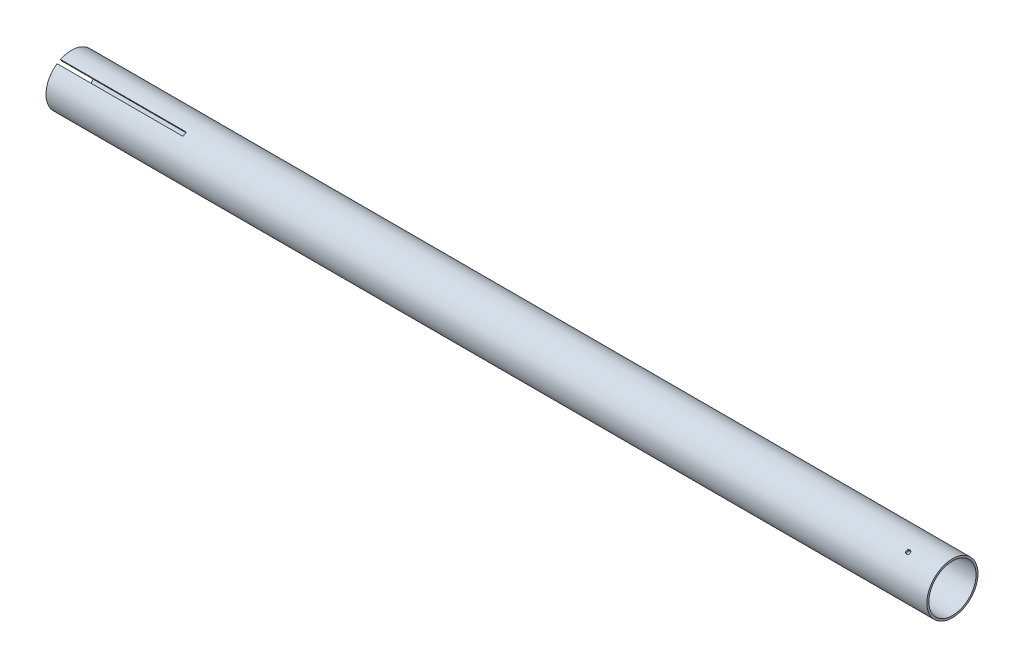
ISO-10303-21;
HEADER;
FILE_DESCRIPTION(('STEP AP214'),'2;1');
FILE_NAME('part.step','',(''),(''),'','','');
FILE_SCHEMA(('AUTOMOTIVE_DESIGN { 1 0 10303 214 1 1 1 1 }'));
ENDSEC;
DATA;
#1=APPLICATION_CONTEXT('core data for automotive mechanical design processes');
#2=APPLICATION_PROTOCOL_DEFINITION('international standard','automotive_design',2000,#1);
#3=PRODUCT_CONTEXT('',#1,'mechanical');
#4=PRODUCT('Part','Part','',(#3));
#5=PRODUCT_RELATED_PRODUCT_CATEGORY('part','',(#4));
#6=PRODUCT_DEFINITION_FORMATION('','',#4);
#7=PRODUCT_DEFINITION_CONTEXT('part definition',#1,'design');
#8=PRODUCT_DEFINITION('design','',#6,#7);
#9=PRODUCT_DEFINITION_SHAPE('','',#8);
#10=(LENGTH_UNIT() NAMED_UNIT(*) SI_UNIT(.MILLI.,.METRE.));
#11=(NAMED_UNIT(*) PLANE_ANGLE_UNIT() SI_UNIT($,.RADIAN.));
#12=(NAMED_UNIT(*) SI_UNIT($,.STERADIAN.) SOLID_ANGLE_UNIT());
#13=UNCERTAINTY_MEASURE_WITH_UNIT(LENGTH_MEASURE(1.E-05),#10,'distance_accuracy_value','');
#14=(GEOMETRIC_REPRESENTATION_CONTEXT(3) GLOBAL_UNCERTAINTY_ASSIGNED_CONTEXT((#13)) GLOBAL_UNIT_ASSIGNED_CONTEXT((#10,
#11,#12)) REPRESENTATION_CONTEXT('',''));
#15=CARTESIAN_POINT('',(0.,0.,0.));
#16=DIRECTION('',(0.,0.,1.));
#17=DIRECTION('',(1.,0.,0.));
#18=AXIS2_PLACEMENT_3D('',#15,#16,#17);
#19=CARTESIAN_POINT('',(0.,0.,0.));
#20=DIRECTION('',(1.,0.,0.));
#21=DIRECTION('',(0.,0.,-1.));
#22=AXIS2_PLACEMENT_3D('',#19,#20,#21);
#23=PLANE('',#22);
#24=CARTESIAN_POINT('',(0.,0.,0.));
#25=DIRECTION('',(1.,0.,0.));
#26=DIRECTION('',(0.,0.,-1.));
#27=AXIS2_PLACEMENT_3D('',#24,#25,#26);
#28=CIRCLE('',#27,20.6375);
#29=CARTESIAN_POINT('',(0.,-18.613393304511,8.9133605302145));
#30=VERTEX_POINT('',#29);
#31=CARTESIAN_POINT('',(0.,-1.58750000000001,-20.576351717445));
#32=VERTEX_POINT('',#31);
#33=EDGE_CURVE('E142',#30,#32,#28,.T.);
#34=ORIENTED_EDGE('',*,*,#33,.F.);
#35=DIRECTION('',(0.,0.866025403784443,-0.499999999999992));
#36=VECTOR('',#35,1.);
#37=CARTESIAN_POINT('',(0.,-25.2081746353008,12.7208593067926));
#38=LINE('',#37,#36);
#39=CARTESIAN_POINT('',(0.,-17.2341501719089,8.11705413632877));
#40=VERTEX_POINT('',#39);
#41=EDGE_CURVE('E127',#30,#40,#38,.T.);
#42=ORIENTED_EDGE('',*,*,#41,.T.);
#43=CARTESIAN_POINT('',(0.,0.,0.));
#44=DIRECTION('',(1.,0.,0.));
#45=DIRECTION('',(0.,0.,-1.));
#46=AXIS2_PLACEMENT_3D('',#43,#44,#45);
#47=CIRCLE('',#46,19.05);
#48=CARTESIAN_POINT('',(0.,-1.58749999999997,-18.9837389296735));
#49=VERTEX_POINT('',#48);
#50=EDGE_CURVE('E183',#40,#49,#47,.T.);
#51=ORIENTED_EDGE('',*,*,#50,.T.);
#52=DIRECTION('',(0.,0.,1.));
#53=VECTOR('',#52,1.);
#54=CARTESIAN_POINT('',(0.,-1.58750000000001,-20.6375));
#55=LINE('',#54,#53);
#56=EDGE_CURVE('E199',#32,#49,#55,.T.);
#57=ORIENTED_EDGE('',*,*,#56,.F.);
#58=EDGE_LOOP('',(#34,#42,#51,#57));
#59=FACE_BOUND('',#58,.T.);
#60=ADVANCED_FACE('F31',(#59),#23,.F.);
#61=CARTESIAN_POINT('',(0.,15.6466501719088,10.8666847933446));
#62=VERTEX_POINT('',#61);
#63=CARTESIAN_POINT('',(0.,-15.646650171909,10.8666847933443));
#64=VERTEX_POINT('',#63);
#65=EDGE_CURVE('E136',#62,#64,#47,.T.);
#66=ORIENTED_EDGE('',*,*,#65,.T.);
#67=DIRECTION('',(0.,0.866025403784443,-0.499999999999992));
#68=VECTOR('',#67,1.);
#69=CARTESIAN_POINT('',(0.,-23.6206746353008,15.4704899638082));
#70=LINE('',#69,#68);
#71=CARTESIAN_POINT('',(0.,-17.025893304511,11.6629911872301));
#72=VERTEX_POINT('',#71);
#73=EDGE_CURVE('E47',#72,#64,#70,.T.);
#74=ORIENTED_EDGE('',*,*,#73,.F.);
#75=CARTESIAN_POINT('',(0.,17.0258933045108,11.6629911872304));
#76=VERTEX_POINT('',#75);
#77=EDGE_CURVE('E134',#76,#72,#28,.T.);
#78=ORIENTED_EDGE('',*,*,#77,.F.);
#79=DIRECTION('',(0.,-0.866025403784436,-0.500000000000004));
#80=VECTOR('',#79,1.);
#81=CARTESIAN_POINT('',(0.,23.6206746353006,15.4704899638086));
#82=LINE('',#81,#80);
#83=EDGE_CURVE('E247',#76,#62,#82,.T.);
#84=ORIENTED_EDGE('',*,*,#83,.T.);
#85=EDGE_LOOP('',(#66,#74,#78,#84));
#86=FACE_BOUND('',#85,.T.);
#87=ADVANCED_FACE('F132',(#86),#23,.F.);
#88=CARTESIAN_POINT('',(711.2,0.,0.));
#89=DIRECTION('',(1.,0.,0.));
#90=DIRECTION('',(0.,0.,-1.));
#91=AXIS2_PLACEMENT_3D('',#88,#89,#90);
#92=PLANE('',#91);
#93=CARTESIAN_POINT('',(711.2,0.,0.));
#94=DIRECTION('',(1.,0.,0.));
#95=DIRECTION('',(0.,0.,-1.));
#96=AXIS2_PLACEMENT_3D('',#93,#94,#95);
#97=CIRCLE('',#96,20.6375);
#98=CARTESIAN_POINT('',(711.2,0.,-20.6375));
#99=VERTEX_POINT('',#98);
#100=EDGE_CURVE('E145',#99,#99,#97,.T.);
#101=ORIENTED_EDGE('',*,*,#100,.T.);
#102=EDGE_LOOP('',(#101));
#103=FACE_BOUND('',#102,.T.);
#104=CARTESIAN_POINT('',(711.2,0.,0.));
#105=DIRECTION('',(1.,0.,0.));
#106=DIRECTION('',(0.,0.,-1.));
#107=AXIS2_PLACEMENT_3D('',#104,#105,#106);
#108=CIRCLE('',#107,19.05);
#109=CARTESIAN_POINT('',(711.2,0.,-19.05));
#110=VERTEX_POINT('',#109);
#111=EDGE_CURVE('E146',#110,#110,#108,.T.);
#112=ORIENTED_EDGE('',*,*,#111,.F.);
#113=EDGE_LOOP('',(#112));
#114=FACE_BOUND('',#113,.T.);
#115=ADVANCED_FACE('F316',(#103,#114),#92,.T.);
#116=CARTESIAN_POINT('',(0.,1.5875,-18.9837389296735));
#117=VERTEX_POINT('',#116);
#118=CARTESIAN_POINT('',(0.,17.2341501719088,8.11705413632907));
#119=VERTEX_POINT('',#118);
#120=EDGE_CURVE('E187',#117,#119,#47,.T.);
#121=ORIENTED_EDGE('',*,*,#120,.T.);
#122=DIRECTION('',(0.,-0.866025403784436,-0.500000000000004));
#123=VECTOR('',#122,1.);
#124=CARTESIAN_POINT('',(0.,25.2081746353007,12.720859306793));
#125=LINE('',#124,#123);
#126=CARTESIAN_POINT('',(0.,18.6133933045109,8.91336053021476));
#127=VERTEX_POINT('',#126);
#128=EDGE_CURVE('E55',#127,#119,#125,.T.);
#129=ORIENTED_EDGE('',*,*,#128,.F.);
#130=CARTESIAN_POINT('',(0.,1.5875,-20.576351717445));
#131=VERTEX_POINT('',#130);
#132=EDGE_CURVE('E141',#131,#127,#28,.T.);
#133=ORIENTED_EDGE('',*,*,#132,.F.);
#134=DIRECTION('',(0.,0.,1.));
#135=VECTOR('',#134,1.);
#136=CARTESIAN_POINT('',(0.,1.5875,-20.6375));
#137=LINE('',#136,#135);
#138=EDGE_CURVE('E262',#131,#117,#137,.T.);
#139=ORIENTED_EDGE('',*,*,#138,.T.);
#140=EDGE_LOOP('',(#121,#129,#133,#139));
#141=FACE_BOUND('',#140,.T.);
#142=ADVANCED_FACE('F312',(#141),#23,.F.);
#143=CARTESIAN_POINT('',(711.2,0.,0.));
#144=DIRECTION('',(-1.,0.,0.));
#145=DIRECTION('',(0.,0.,1.));
#146=AXIS2_PLACEMENT_3D('',#143,#144,#145);
#147=CYLINDRICAL_SURFACE('',#146,20.6375);
#148=CARTESIAN_POINT('',(685.8,-17.025893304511,11.6629911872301));
#149=CARTESIAN_POINT('',(685.889028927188,-17.0258959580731,11.6629882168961));
#150=CARTESIAN_POINT('',(685.978119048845,-17.0301563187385,11.6567754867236));
#151=CARTESIAN_POINT('',(686.153835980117,-17.0470478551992,11.6320583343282));
#152=CARTESIAN_POINT('',(686.240459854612,-17.0596886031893,11.6135398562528));
#153=CARTESIAN_POINT('',(686.408673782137,-17.0928498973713,11.5646770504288));
#154=CARTESIAN_POINT('',(686.490266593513,-17.1133660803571,11.5343392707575));
#155=CARTESIAN_POINT('',(686.646142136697,-17.1614988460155,11.4626009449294));
#156=CARTESIAN_POINT('',(686.720426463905,-17.1891138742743,11.4212028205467));
#157=CARTESIAN_POINT('',(686.859760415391,-17.2504920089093,11.3282844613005));
#158=CARTESIAN_POINT('',(686.924791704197,-17.284267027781,11.27674459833));
#159=CARTESIAN_POINT('',(687.043616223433,-17.3567242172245,11.1648986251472));
#160=CARTESIAN_POINT('',(687.097408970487,-17.39540659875,11.1045921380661));
#161=CARTESIAN_POINT('',(687.192289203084,-17.4763941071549,10.9766927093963));
#162=CARTESIAN_POINT('',(687.233361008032,-17.5187036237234,10.9090909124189));
#163=CARTESIAN_POINT('',(687.301533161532,-17.6054979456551,10.768457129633));
#164=CARTESIAN_POINT('',(687.328633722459,-17.6499827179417,10.6954252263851));
#165=CARTESIAN_POINT('',(687.368041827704,-17.7396246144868,10.5460746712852));
#166=CARTESIAN_POINT('',(687.38037879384,-17.7847802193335,10.4697628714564));
#167=CARTESIAN_POINT('',(687.390000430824,-17.8744944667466,10.3158512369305));
#168=CARTESIAN_POINT('',(687.387285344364,-17.9190531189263,10.2382514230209));
#169=CARTESIAN_POINT('',(687.366904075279,-18.00622580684,10.0841490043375));
#170=CARTESIAN_POINT('',(687.349269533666,-18.0488437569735,10.0076444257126));
#171=CARTESIAN_POINT('',(687.299599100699,-18.13112639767,9.85778747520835));
#172=CARTESIAN_POINT('',(687.267563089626,-18.1707910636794,9.7844351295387));
#173=CARTESIAN_POINT('',(687.18996364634,-18.2462575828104,9.64297316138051));
#174=CARTESIAN_POINT('',(687.144385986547,-18.2820553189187,9.5748691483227));
#175=CARTESIAN_POINT('',(687.041007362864,-18.3489560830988,9.44603063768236));
#176=CARTESIAN_POINT('',(686.983206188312,-18.380059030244,9.38529626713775));
#177=CARTESIAN_POINT('',(686.856842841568,-18.4370204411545,9.27289990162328));
#178=CARTESIAN_POINT('',(686.788253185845,-18.46286511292,9.22126181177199));
#179=CARTESIAN_POINT('',(686.642355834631,-18.5087285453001,9.12885773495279));
#180=CARTESIAN_POINT('',(686.565048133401,-18.5287473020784,9.08809175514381));
#181=CARTESIAN_POINT('',(686.403890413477,-18.5626131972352,9.018719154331));
#182=CARTESIAN_POINT('',(686.320039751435,-18.5764597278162,8.99011373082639));
#183=CARTESIAN_POINT('',(686.148185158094,-18.5977490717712,8.94599022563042));
#184=CARTESIAN_POINT('',(686.060181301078,-18.6051919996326,8.9304719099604));
#185=CARTESIAN_POINT('',(685.882759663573,-18.6135443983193,8.91305033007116));
#186=CARTESIAN_POINT('',(685.793346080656,-18.6144705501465,8.91111230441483));
#187=CARTESIAN_POINT('',(685.615431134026,-18.609818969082,8.92082238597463));
#188=CARTESIAN_POINT('',(685.526929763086,-18.6042412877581,8.9324703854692));
#189=CARTESIAN_POINT('',(685.353461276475,-18.5866815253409,8.96895093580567));
#190=CARTESIAN_POINT('',(685.268489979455,-18.5747072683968,8.99376737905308));
#191=CARTESIAN_POINT('',(685.10436429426,-18.5445536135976,9.05577822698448));
#192=CARTESIAN_POINT('',(685.025209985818,-18.5263741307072,9.09297280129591));
#193=CARTESIAN_POINT('',(684.874789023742,-18.48407513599,9.17865192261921));
#194=CARTESIAN_POINT('',(684.803538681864,-18.4599436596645,9.22715919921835));
#195=CARTESIAN_POINT('',(684.671112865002,-18.4061963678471,9.33391147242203));
#196=CARTESIAN_POINT('',(684.609937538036,-18.3765804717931,9.39215661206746));
#197=CARTESIAN_POINT('',(684.499267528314,-18.3123759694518,9.51673283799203));
#198=CARTESIAN_POINT('',(684.449797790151,-18.2777769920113,9.58308074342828));
#199=CARTESIAN_POINT('',(684.364114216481,-18.2043963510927,9.72175422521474));
#200=CARTESIAN_POINT('',(684.327900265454,-18.1656147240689,9.79407974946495));
#201=CARTESIAN_POINT('',(684.269799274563,-18.0848243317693,9.94246739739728));
#202=CARTESIAN_POINT('',(684.247896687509,-18.0428191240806,10.0185253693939));
#203=CARTESIAN_POINT('',(684.218989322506,-17.9566198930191,10.1722154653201));
#204=CARTESIAN_POINT('',(684.211984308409,-17.9124259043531,10.2498475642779));
#205=CARTESIAN_POINT('',(684.213073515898,-17.8231871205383,10.4042461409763));
#206=CARTESIAN_POINT('',(684.221128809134,-17.7781448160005,10.4810143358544));
#207=CARTESIAN_POINT('',(684.252028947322,-17.6884235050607,10.631734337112));
#208=CARTESIAN_POINT('',(684.274873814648,-17.6437444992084,10.7056861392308));
#209=CARTESIAN_POINT('',(684.334695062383,-17.5561410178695,10.8487492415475));
#210=CARTESIAN_POINT('',(684.371670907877,-17.5132164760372,10.9178607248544));
#211=CARTESIAN_POINT('',(684.45869983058,-17.4305192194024,11.0494094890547));
#212=CARTESIAN_POINT('',(684.508752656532,-17.390746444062,11.1118468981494));
#213=CARTESIAN_POINT('',(684.620660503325,-17.3156081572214,11.2285777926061));
#214=CARTESIAN_POINT('',(684.682544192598,-17.2802537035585,11.2828509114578));
#215=CARTESIAN_POINT('',(684.816308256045,-17.2153083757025,11.3816989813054));
#216=CARTESIAN_POINT('',(684.888191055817,-17.1857189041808,11.4262715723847));
#217=CARTESIAN_POINT('',(685.040032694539,-17.1333530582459,11.5046447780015));
#218=CARTESIAN_POINT('',(685.120004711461,-17.1105880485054,11.5384274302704));
#219=CARTESIAN_POINT('',(685.285603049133,-17.0728174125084,11.5942424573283));
#220=CARTESIAN_POINT('',(685.371222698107,-17.0578028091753,11.616288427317));
#221=CARTESIAN_POINT('',(685.514461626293,-17.0399594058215,11.6424367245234));
#222=CARTESIAN_POINT('',(685.571158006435,-17.0346935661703,11.6501356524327));
#223=CARTESIAN_POINT('',(685.685227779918,-17.0276596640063,11.6604138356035));
#224=CARTESIAN_POINT('',(685.742601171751,-17.0258915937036,11.662993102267));
#225=CARTESIAN_POINT('',(685.8,-17.025893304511,11.6629911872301));
#226=B_SPLINE_CURVE_WITH_KNOTS('',3,(#148,#149,#150,#151,#152,#153,#154,#155,#156,#157,#158,
#159,#160,#161,#162,#163,#164,#165,#166,#167,#168,#169,#170,#171,#172,#173,#174,#175,#176,#177,
#178,#179,#180,#181,#182,#183,#184,#185,#186,#187,#188,#189,#190,#191,#192,#193,#194,#195,#196,
#197,#198,#199,#200,#201,#202,#203,#204,#205,#206,#207,#208,#209,#210,#211,#212,#213,#214,#215,
#216,#217,#218,#219,#220,#221,#222,#223,#224,#225),.UNSPECIFIED.,.T.,.F.,(4,2,2,2,2,2,2,2,2,2,2,
2,2,2,2,2,2,2,2,2,2,2,2,2,2,2,2,2,2,2,2,2,2,2,2,2,2,2,4),(0.,0.266877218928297,
0.534059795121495,0.801094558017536,1.06807089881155,1.33556911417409,1.60307883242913,
1.87091699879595,2.13875109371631,2.40605053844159,2.67334567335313,2.94007534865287,
3.20680724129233,3.47382037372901,3.7408381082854,4.00854742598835,4.27625691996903,
4.54399277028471,4.81172383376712,5.07876933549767,5.34581271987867,5.61253020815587,
5.87925135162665,6.14651308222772,6.41377873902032,6.68160891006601,6.94943674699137,
7.2169731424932,7.48450529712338,7.75134688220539,8.01818887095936,8.28502075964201,
8.5518475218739,8.81932924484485,9.08687596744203,9.3548657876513,9.62254450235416,
9.79460626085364,9.96666763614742),.UNSPECIFIED.);
#227=CARTESIAN_POINT('',(685.8,-17.025893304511,11.6629911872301));
#228=VERTEX_POINT('',#227);
#229=EDGE_CURVE('E273',#228,#228,#226,.T.);
#230=ORIENTED_EDGE('',*,*,#229,.T.);
#231=EDGE_LOOP('',(#230));
#232=FACE_BOUND('',#231,.T.);
#233=CARTESIAN_POINT('',(685.8,18.6133933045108,8.91336053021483));
#234=CARTESIAN_POINT('',(685.889028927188,18.6133920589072,8.91336431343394));
#235=CARTESIAN_POINT('',(685.978119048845,18.6101418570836,8.92016025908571));
#236=CARTESIAN_POINT('',(686.153835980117,18.5971819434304,8.94714733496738));
#237=CARTESIAN_POINT('',(686.240459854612,18.5874648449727,8.96735378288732));
#238=CARTESIAN_POINT('',(686.408673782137,18.5617290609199,9.02050370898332));
#239=CARTESIAN_POINT('',(686.490266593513,18.5457138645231,9.05344013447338));
#240=CARTESIAN_POINT('',(686.646142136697,18.5076530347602,9.13099349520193));
#241=CARTESIAN_POINT('',(686.720426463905,18.4856087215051,9.17560787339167));
#242=CARTESIAN_POINT('',(686.859760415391,18.4358281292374,9.2752220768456));
#243=CARTESIAN_POINT('',(686.924791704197,18.4080808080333,9.33024203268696));
#244=CARTESIAN_POINT('',(687.043616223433,18.3474479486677,9.4489147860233));
#245=CARTESIAN_POINT('',(687.097408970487,18.3145621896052,9.51256795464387));
#246=CARTESIAN_POINT('',(687.192289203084,18.2442917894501,9.64665490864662));
#247=CARTESIAN_POINT('',(687.233361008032,18.2069016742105,9.71709692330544));
#248=CARTESIAN_POINT('',(687.301533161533,18.1285064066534,9.86257990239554));
#249=CARTESIAN_POINT('',(687.328633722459,18.0875013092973,9.93762079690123));
#250=CARTESIAN_POINT('',(687.368041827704,18.0029808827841,10.0899282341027));
#251=CARTESIAN_POINT('',(687.38037879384,17.9594707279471,10.1671900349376));
#252=CARTESIAN_POINT('',(687.390000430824,17.8710364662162,10.3218406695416));
#253=CARTESIAN_POINT('',(687.387285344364,17.8261123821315,10.3992295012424));
#254=CARTESIAN_POINT('',(687.366904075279,17.7362421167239,10.5517744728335));
#255=CARTESIAN_POINT('',(687.349269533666,17.6912961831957,10.6269349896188));
#256=CARTESIAN_POINT('',(687.299599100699,17.6026575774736,10.7731223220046));
#257=CARTESIAN_POINT('',(687.267563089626,17.5589649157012,10.8441491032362));
#258=CARTESIAN_POINT('',(687.18996364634,17.4741885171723,10.9802360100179));
#259=CARTESIAN_POINT('',(687.144385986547,17.4331075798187,11.0452897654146));
#260=CARTESIAN_POINT('',(687.041007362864,17.3549805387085,11.1676467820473));
#261=CARTESIAN_POINT('',(686.983206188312,17.3179345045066,11.2249499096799));
#262=CARTESIAN_POINT('',(686.856842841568,17.2490771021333,11.330478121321));
#263=CARTESIAN_POINT('',(686.788253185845,17.217279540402,11.3786793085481));
#264=CARTESIAN_POINT('',(686.642355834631,17.1601869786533,11.4646002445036));
#265=CARTESIAN_POINT('',(686.565048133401,17.1348919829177,11.5023199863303));
#266=CARTESIAN_POINT('',(686.403890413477,17.0917464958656,11.5663350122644));
#267=CARTESIAN_POINT('',(686.320039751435,17.0738967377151,11.5926291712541));
#268=CARTESIAN_POINT('',(686.148185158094,17.0463293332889,11.633128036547));
#269=CARTESIAN_POINT('',(686.060181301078,17.0366115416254,11.6473329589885));
#270=CARTESIAN_POINT('',(685.882759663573,17.0257002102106,11.6632771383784));
#271=CARTESIAN_POINT('',(685.793346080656,17.0244849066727,11.6650482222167));
#272=CARTESIAN_POINT('',(685.615431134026,17.030568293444,11.6561647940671));
#273=CARTESIAN_POINT('',(685.526929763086,17.0378669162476,11.6455103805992));
#274=CARTESIAN_POINT('',(685.353461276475,17.0606801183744,11.6120629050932));
#275=CARTESIAN_POINT('',(685.268489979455,17.0761846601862,11.5892846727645));
#276=CARTESIAN_POINT('',(685.10436429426,17.1148108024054,11.5321654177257));
#277=CARTESIAN_POINT('',(685.025209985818,17.1379325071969,11.4978242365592));
#278=CARTESIAN_POINT('',(684.874789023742,17.1909833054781,11.4183526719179));
#279=CARTESIAN_POINT('',(684.803538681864,17.2209261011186,11.3732005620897));
#280=CARTESIAN_POINT('',(684.671112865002,17.2865026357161,11.2732779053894));
#281=CARTESIAN_POINT('',(684.609937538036,17.322136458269,11.2185072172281));
#282=CARTESIAN_POINT('',(684.499267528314,17.3979203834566,11.1006163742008));
#283=CARTESIAN_POINT('',(684.449797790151,17.4380798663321,11.0374788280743));
#284=CARTESIAN_POINT('',(684.364114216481,17.521484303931,10.9045925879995));
#285=CARTESIAN_POINT('',(684.327900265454,17.5647292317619,10.8348439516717));
#286=CARTESIAN_POINT('',(684.269799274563,17.6528415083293,10.6906835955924));
#287=CARTESIAN_POINT('',(684.247896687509,17.6977070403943,10.6162770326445));
#288=CARTESIAN_POINT('',(684.218989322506,17.7877069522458,10.4647812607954));
#289=CARTESIAN_POINT('',(684.211984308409,17.8328413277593,10.3876920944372));
#290=CARTESIAN_POINT('',(684.213073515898,17.9219350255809,10.2332097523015));
#291=CARTESIAN_POINT('',(684.221128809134,17.9658970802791,10.1558178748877));
#292=CARTESIAN_POINT('',(684.252028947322,18.0515637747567,10.0027569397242));
#293=CARTESIAN_POINT('',(684.274873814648,18.0932684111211,9.92708788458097));
#294=CARTESIAN_POINT('',(684.334695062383,18.1733629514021,9.7796894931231));
#295=CARTESIAN_POINT('',(684.371670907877,18.211752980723,9.70796000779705));
#296=CARTESIAN_POINT('',(684.45869983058,18.2843289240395,9.5705677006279));
#297=CARTESIAN_POINT('',(684.508752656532,18.3185149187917,9.50490476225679));
#298=CARTESIAN_POINT('',(684.620660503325,18.3820376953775,9.38146764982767));
#299=CARTESIAN_POINT('',(684.682544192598,18.4113623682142,9.32371323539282));
#300=CARTESIAN_POINT('',(684.816308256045,18.4644946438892,9.21804489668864));
#301=CARTESIAN_POINT('',(684.888191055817,18.4883009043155,9.17013336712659));
#302=CARTESIAN_POINT('',(685.040032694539,18.5299911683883,9.08559661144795));
#303=CARTESIAN_POINT('',(685.120004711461,18.5478652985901,9.04899020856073));
#304=CARTESIAN_POINT('',(685.285603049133,18.5773172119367,8.98837236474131));
#305=CARTESIAN_POINT('',(685.371222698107,18.5889022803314,8.96434635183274));
#306=CARTESIAN_POINT('',(685.514461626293,18.6026256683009,8.9358193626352));
#307=CARTESIAN_POINT('',(685.571158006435,18.6066602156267,8.92740954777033));
#308=CARTESIAN_POINT('',(685.685227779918,18.6120444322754,8.91617891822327));
#309=CARTESIAN_POINT('',(685.742601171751,18.6133941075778,8.91335809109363));
#310=CARTESIAN_POINT('',(685.8,18.6133933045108,8.91336053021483));
#311=B_SPLINE_CURVE_WITH_KNOTS('',3,(#233,#234,#235,#236,#237,#238,#239,#240,#241,#242,#243,
#244,#245,#246,#247,#248,#249,#250,#251,#252,#253,#254,#255,#256,#257,#258,#259,#260,#261,#262,
#263,#264,#265,#266,#267,#268,#269,#270,#271,#272,#273,#274,#275,#276,#277,#278,#279,#280,#281,
#282,#283,#284,#285,#286,#287,#288,#289,#290,#291,#292,#293,#294,#295,#296,#297,#298,#299,#300,
#301,#302,#303,#304,#305,#306,#307,#308,#309,#310),.UNSPECIFIED.,.T.,.F.,(4,2,2,2,2,2,2,2,2,2,2,
2,2,2,2,2,2,2,2,2,2,2,2,2,2,2,2,2,2,2,2,2,2,2,2,2,2,2,4),(0.,0.266877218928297,
0.534059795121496,0.801094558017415,1.06807089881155,1.33556911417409,1.60307883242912,
1.87091699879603,2.13875109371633,2.40605053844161,2.67334567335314,2.94007534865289,
3.20680724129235,3.47382037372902,3.74083810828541,4.00854742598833,4.27625691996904,
4.5439927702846,4.81172383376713,5.07876933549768,5.34581271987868,5.61253020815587,
5.87925135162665,6.14651308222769,6.41377873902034,6.68160891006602,6.94943674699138,
7.21697314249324,7.48450529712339,7.75134688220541,8.01818887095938,8.28502075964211,
8.55184752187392,8.81932924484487,9.08687596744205,9.35486578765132,9.62254450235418,
9.79460626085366,9.96666763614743),.UNSPECIFIED.);
#312=CARTESIAN_POINT('',(685.8,18.6133933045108,8.91336053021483));
#313=VERTEX_POINT('',#312);
#314=EDGE_CURVE('E161',#313,#313,#311,.T.);
#315=ORIENTED_EDGE('',*,*,#314,.T.);
#316=EDGE_LOOP('',(#315));
#317=FACE_BOUND('',#316,.T.);
#318=CARTESIAN_POINT('',(687.3875,0.,-20.6375));
#319=CARTESIAN_POINT('',(687.387496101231,0.0890293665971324,-20.6374991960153));
#320=CARTESIAN_POINT('',(687.379985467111,0.178119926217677,-20.6369177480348));
#321=CARTESIAN_POINT('',(687.350133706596,0.353837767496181,-20.6346541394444));
#322=CARTESIAN_POINT('',(687.327775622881,0.440462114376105,-20.6329707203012));
#323=CARTESIAN_POINT('',(687.268877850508,0.608677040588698,-20.6286934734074));
#324=CARTESIAN_POINT('',(687.232346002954,0.690270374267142,-20.6261001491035));
#325=CARTESIAN_POINT('',(687.146151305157,0.846146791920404,-20.6202942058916));
#326=CARTESIAN_POINT('',(687.096491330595,0.920431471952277,-20.6170817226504));
#327=CARTESIAN_POINT('',(686.985331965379,1.05976502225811,-20.610390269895));
#328=CARTESIAN_POINT('',(686.923809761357,1.12479566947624,-20.6069107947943));
#329=CARTESIAN_POINT('',(686.790720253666,1.24361895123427,-20.6000817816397));
#330=CARTESIAN_POINT('',(686.719152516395,1.29741110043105,-20.5967322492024));
#331=CARTESIAN_POINT('',(686.567894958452,1.39229071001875,-20.5905367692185));
#332=CARTESIAN_POINT('',(686.488195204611,1.43336237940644,-20.5876914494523));
#333=CARTESIAN_POINT('',(686.323005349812,1.50153424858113,-20.5828320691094));
#334=CARTESIAN_POINT('',(686.237515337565,1.52863466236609,-20.5808179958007));
#335=CARTESIAN_POINT('',(686.063352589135,1.56804245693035,-20.5778532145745));
#336=CARTESIAN_POINT('',(685.97468654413,1.58037924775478,-20.576900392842));
#337=CARTESIAN_POINT('',(685.796537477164,1.59000043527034,-20.5761592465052));
#338=CARTESIAN_POINT('',(685.7070544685,1.58728507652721,-20.5763709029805));
#339=CARTESIAN_POINT('',(685.530012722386,1.56690337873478,-20.5779328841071));
#340=CARTESIAN_POINT('',(685.442450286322,1.54926895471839,-20.5792807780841));
#341=CARTESIAN_POINT('',(685.271531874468,1.49959925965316,-20.5829595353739));
#342=CARTESIAN_POINT('',(685.188175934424,1.46756386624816,-20.5852904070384));
#343=CARTESIAN_POINT('',(685.02793468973,1.38996569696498,-20.5906752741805));
#344=CARTESIAN_POINT('',(684.951056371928,1.34438854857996,-20.5937300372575));
#345=CARTESIAN_POINT('',(684.806029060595,1.24101101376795,-20.6002177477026));
#346=CARTESIAN_POINT('',(684.737880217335,1.18321041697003,-20.6036507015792));
#347=CARTESIAN_POINT('',(684.612060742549,1.05684747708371,-20.6105187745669));
#348=CARTESIAN_POINT('',(684.554417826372,0.988257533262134,-20.6139538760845));
#349=CARTESIAN_POINT('',(684.451460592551,0.842359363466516,-20.6204306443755));
#350=CARTESIAN_POINT('',(684.406146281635,0.765051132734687,-20.6234723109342));
#351=CARTESIAN_POINT('',(684.329134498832,0.60389327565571,-20.628819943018));
#352=CARTESIAN_POINT('',(684.297438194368,0.520043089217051,-20.6311258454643));
#353=CARTESIAN_POINT('',(684.248581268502,0.348189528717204,-20.6347413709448));
#354=CARTESIAN_POINT('',(684.231420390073,0.260186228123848,-20.6360510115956));
#355=CARTESIAN_POINT('',(684.21215606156,0.0827648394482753,-20.6375241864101));
#356=CARTESIAN_POINT('',(684.210014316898,-0.00664906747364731,-20.6376906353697));
#357=CARTESIAN_POINT('',(684.220748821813,-0.184564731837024,-20.6368664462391));
#358=CARTESIAN_POINT('',(684.233624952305,-0.273066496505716,-20.6358758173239));
#359=CARTESIAN_POINT('',(684.273997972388,-0.446536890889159,-20.6328507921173));
#360=CARTESIAN_POINT('',(684.301477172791,-0.531509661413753,-20.6308176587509));
#361=CARTESIAN_POINT('',(684.370258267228,-0.695638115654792,-20.6259361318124));
#362=CARTESIAN_POINT('',(684.411560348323,-0.774793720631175,-20.6230877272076));
#363=CARTESIAN_POINT('',(684.50691144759,-0.925215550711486,-20.6168879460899));
#364=CARTESIAN_POINT('',(684.560985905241,-0.996465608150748,-20.6135355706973));
#365=CARTESIAN_POINT('',(684.680309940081,-1.12889076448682,-20.6067080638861));
#366=CARTESIAN_POINT('',(684.745559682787,-1.19006571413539,-20.6032329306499));
#367=CARTESIAN_POINT('',(684.885547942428,-1.3007349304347,-20.5965430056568));
#368=CARTESIAN_POINT('',(684.960306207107,-1.35020425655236,-20.5933287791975));
#369=CARTESIAN_POINT('',(685.117090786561,-1.4358871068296,-20.5875323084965));
#370=CARTESIAN_POINT('',(685.199117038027,-1.47210074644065,-20.5849500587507));
#371=CARTESIAN_POINT('',(685.368019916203,-1.53020152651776,-20.5807128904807));
#372=CARTESIAN_POINT('',(685.454891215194,-1.5521040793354,-20.579056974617));
#373=CARTESIAN_POINT('',(685.631091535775,-1.58101118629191,-20.5768564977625));
#374=CARTESIAN_POINT('',(685.720420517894,-1.58801597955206,-20.5763119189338));
#375=CARTESIAN_POINT('',(685.898752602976,-1.5869261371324,-20.5763959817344));
#376=CARTESIAN_POINT('',(685.987755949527,-1.57887069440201,-20.577021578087));
#377=CARTESIAN_POINT('',(686.163141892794,-1.54797061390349,-20.5793690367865));
#378=CARTESIAN_POINT('',(686.249524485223,-1.52512595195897,-20.5810909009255));
#379=CARTESIAN_POINT('',(686.417220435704,-1.46530550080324,-20.5854360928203));
#380=CARTESIAN_POINT('',(686.498533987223,-1.42833025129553,-20.5880593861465));
#381=CARTESIAN_POINT('',(686.653805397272,-1.34130283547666,-20.5939118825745));
#382=CARTESIAN_POINT('',(686.727763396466,-1.29125091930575,-20.597141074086));
#383=CARTESIAN_POINT('',(686.866424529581,-1.17934406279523,-20.6038514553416));
#384=CARTESIAN_POINT('',(686.931104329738,-1.1174602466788,-20.6073332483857));
#385=CARTESIAN_POINT('',(687.049183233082,-0.983695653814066,-20.6141510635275));
#386=CARTESIAN_POINT('',(687.102579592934,-0.91181245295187,-20.6174870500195));
#387=CARTESIAN_POINT('',(687.196636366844,-0.75997049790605,-20.6236425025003));
#388=CARTESIAN_POINT('',(687.237275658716,-0.67999863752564,-20.6264611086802));
#389=CARTESIAN_POINT('',(687.304498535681,-0.514400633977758,-20.63125375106));
#390=CARTESIAN_POINT('',(687.331098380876,-0.428781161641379,-20.6332287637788));
#391=CARTESIAN_POINT('',(687.362665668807,-0.285541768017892,-20.6356010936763));
#392=CARTESIAN_POINT('',(687.371966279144,-0.228844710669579,-20.6363099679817));
#393=CARTESIAN_POINT('',(687.384384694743,-0.114773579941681,-20.6372596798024));
#394=CARTESIAN_POINT('',(687.387502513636,-0.0573995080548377,-20.6375005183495));
#395=CARTESIAN_POINT('',(687.3875,0.,-20.6375));
#396=B_SPLINE_CURVE_WITH_KNOTS('',3,(#318,#319,#320,#321,#322,#323,#324,#325,#326,#327,#328,
#329,#330,#331,#332,#333,#334,#335,#336,#337,#338,#339,#340,#341,#342,#343,#344,#345,#346,#347,
#348,#349,#350,#351,#352,#353,#354,#355,#356,#357,#358,#359,#360,#361,#362,#363,#364,#365,#366,
#367,#368,#369,#370,#371,#372,#373,#374,#375,#376,#377,#378,#379,#380,#381,#382,#383,#384,#385,
#386,#387,#388,#389,#390,#391,#392,#393,#394,#395),.UNSPECIFIED.,.T.,.F.,(4,2,2,2,2,2,2,2,2,2,2,
2,2,2,2,2,2,2,2,2,2,2,2,2,2,2,2,2,2,2,2,2,2,2,2,2,2,2,4),(0.,0.266878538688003,
0.534062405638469,0.801098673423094,1.06807649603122,1.33557298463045,1.60308102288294,
1.87091982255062,2.13875451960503,2.40605478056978,2.67335069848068,2.94007625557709,
3.20680407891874,3.47381601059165,3.74083253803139,4.00854358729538,4.27625478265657,
4.54398892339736,4.81171832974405,5.07876485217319,5.34580925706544,5.6125309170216,
5.87925618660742,6.14651725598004,6.41378228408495,6.68161173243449,6.9494388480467,
7.21697704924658,7.48451095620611,7.75134959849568,8.0181886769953,8.28501756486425,
8.55184134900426,8.81932482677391,9.08687326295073,9.35486237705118,9.62254042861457,
9.79460422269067,9.96666763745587),.UNSPECIFIED.);
#397=CARTESIAN_POINT('',(687.3875,0.,-20.6375));
#398=VERTEX_POINT('',#397);
#399=EDGE_CURVE('E160',#398,#398,#396,.T.);
#400=ORIENTED_EDGE('',*,*,#399,.T.);
#401=EDGE_LOOP('',(#400));
#402=FACE_BOUND('',#401,.T.);
#403=ORIENTED_EDGE('',*,*,#100,.F.);
#404=EDGE_LOOP('',(#403));
#405=FACE_BOUND('',#404,.T.);
#406=CARTESIAN_POINT('',(101.6,0.,0.));
#407=DIRECTION('',(1.,0.,0.));
#408=DIRECTION('',(0.,0.,-1.));
#409=AXIS2_PLACEMENT_3D('',#406,#407,#408);
#410=CIRCLE('',#409,20.6375);
#411=CARTESIAN_POINT('',(101.6,-17.025893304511,11.6629911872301));
#412=VERTEX_POINT('',#411);
#413=CARTESIAN_POINT('',(101.6,-18.613393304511,8.9133605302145));
#414=VERTEX_POINT('',#413);
#415=EDGE_CURVE('E126',#412,#414,#410,.T.);
#416=ORIENTED_EDGE('',*,*,#415,.T.);
#417=DIRECTION('',(-1.,0.,0.));
#418=VECTOR('',#417,1.);
#419=CARTESIAN_POINT('',(711.2,-18.613393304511,8.9133605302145));
#420=LINE('',#419,#418);
#421=EDGE_CURVE('E240',#414,#30,#420,.T.);
#422=ORIENTED_EDGE('',*,*,#421,.T.);
#423=ORIENTED_EDGE('',*,*,#33,.T.);
#424=DIRECTION('',(-1.,0.,0.));
#425=VECTOR('',#424,1.);
#426=CARTESIAN_POINT('',(711.2,-1.58749999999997,-20.576351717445));
#427=LINE('',#426,#425);
#428=CARTESIAN_POINT('',(101.6,-1.5875,-20.576351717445));
#429=VERTEX_POINT('',#428);
#430=EDGE_CURVE('E209',#32,#429,#427,.F.);
#431=ORIENTED_EDGE('',*,*,#430,.T.);
#432=CARTESIAN_POINT('',(101.6,0.,0.));
#433=DIRECTION('',(1.,0.,0.));
#434=DIRECTION('',(0.,0.,-1.));
#435=AXIS2_PLACEMENT_3D('',#432,#433,#434);
#436=CIRCLE('',#435,20.6375);
#437=CARTESIAN_POINT('',(101.6,1.5875,-20.576351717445));
#438=VERTEX_POINT('',#437);
#439=EDGE_CURVE('E269',#429,#438,#436,.T.);
#440=ORIENTED_EDGE('',*,*,#439,.T.);
#441=DIRECTION('',(-1.,0.,0.));
#442=VECTOR('',#441,1.);
#443=CARTESIAN_POINT('',(711.2,1.58750000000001,-20.576351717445));
#444=LINE('',#443,#442);
#445=EDGE_CURVE('E271',#438,#131,#444,.T.);
#446=ORIENTED_EDGE('',*,*,#445,.T.);
#447=ORIENTED_EDGE('',*,*,#132,.T.);
#448=DIRECTION('',(-1.,0.,0.));
#449=VECTOR('',#448,1.);
#450=CARTESIAN_POINT('',(711.2,18.6133933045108,8.91336053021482));
#451=LINE('',#450,#449);
#452=CARTESIAN_POINT('',(101.6,18.6133933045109,8.91336053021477));
#453=VERTEX_POINT('',#452);
#454=EDGE_CURVE('E249',#127,#453,#451,.F.);
#455=ORIENTED_EDGE('',*,*,#454,.T.);
#456=CARTESIAN_POINT('',(101.6,0.,0.));
#457=DIRECTION('',(1.,0.,0.));
#458=DIRECTION('',(0.,0.,-1.));
#459=AXIS2_PLACEMENT_3D('',#456,#457,#458);
#460=CIRCLE('',#459,20.6375);
#461=CARTESIAN_POINT('',(101.6,17.0258933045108,11.6629911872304));
#462=VERTEX_POINT('',#461);
#463=EDGE_CURVE('E259',#453,#462,#460,.T.);
#464=ORIENTED_EDGE('',*,*,#463,.T.);
#465=DIRECTION('',(-1.,0.,0.));
#466=VECTOR('',#465,1.);
#467=CARTESIAN_POINT('',(711.2,17.0258933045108,11.6629911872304));
#468=LINE('',#467,#466);
#469=EDGE_CURVE('E140',#462,#76,#468,.T.);
#470=ORIENTED_EDGE('',*,*,#469,.T.);
#471=ORIENTED_EDGE('',*,*,#77,.T.);
#472=DIRECTION('',(-1.,0.,0.));
#473=VECTOR('',#472,1.);
#474=CARTESIAN_POINT('',(711.2,-17.0258933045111,11.66299118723));
#475=LINE('',#474,#473);
#476=EDGE_CURVE('E119',#72,#412,#475,.F.);
#477=ORIENTED_EDGE('',*,*,#476,.T.);
#478=EDGE_LOOP('',(#416,#422,#423,#431,#440,#446,#447,#455,#464,#470,#471,#477));
#479=FACE_BOUND('',#478,.T.);
#480=ADVANCED_FACE('F33',(#232,#317,#402,#405,#479),#147,.T.);
#481=CARTESIAN_POINT('',(711.2,0.,0.));
#482=DIRECTION('',(-1.,0.,0.));
#483=DIRECTION('',(0.,0.,1.));
#484=AXIS2_PLACEMENT_3D('',#481,#482,#483);
#485=CYLINDRICAL_SURFACE('',#484,19.05);
#486=DIRECTION('',(-1.,0.,0.));
#487=VECTOR('',#486,1.);
#488=CARTESIAN_POINT('',(711.2,-17.2341501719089,8.11705413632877));
#489=LINE('',#488,#487);
#490=CARTESIAN_POINT('',(101.6,-17.2341501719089,8.11705413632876));
#491=VERTEX_POINT('',#490);
#492=EDGE_CURVE('E11',#491,#40,#489,.T.);
#493=ORIENTED_EDGE('',*,*,#492,.F.);
#494=CARTESIAN_POINT('',(101.6,0.,0.));
#495=DIRECTION('',(1.,0.,0.));
#496=DIRECTION('',(0.,0.,-1.));
#497=AXIS2_PLACEMENT_3D('',#494,#495,#496);
#498=CIRCLE('',#497,19.05);
#499=CARTESIAN_POINT('',(101.6,-15.646650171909,10.8666847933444));
#500=VERTEX_POINT('',#499);
#501=EDGE_CURVE('E40',#500,#491,#498,.T.);
#502=ORIENTED_EDGE('',*,*,#501,.F.);
#503=DIRECTION('',(-1.,0.,0.));
#504=VECTOR('',#503,1.);
#505=CARTESIAN_POINT('',(711.2,-15.646650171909,10.8666847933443));
#506=LINE('',#505,#504);
#507=EDGE_CURVE('E230',#64,#500,#506,.F.);
#508=ORIENTED_EDGE('',*,*,#507,.F.);
#509=ORIENTED_EDGE('',*,*,#65,.F.);
#510=DIRECTION('',(-1.,0.,0.));
#511=VECTOR('',#510,1.);
#512=CARTESIAN_POINT('',(711.2,15.6466501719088,10.8666847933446));
#513=LINE('',#512,#511);
#514=CARTESIAN_POINT('',(101.6,15.6466501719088,10.8666847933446));
#515=VERTEX_POINT('',#514);
#516=EDGE_CURVE('E228',#515,#62,#513,.T.);
#517=ORIENTED_EDGE('',*,*,#516,.F.);
#518=CARTESIAN_POINT('',(101.6,0.,0.));
#519=DIRECTION('',(1.,0.,0.));
#520=DIRECTION('',(0.,0.,-1.));
#521=AXIS2_PLACEMENT_3D('',#518,#519,#520);
#522=CIRCLE('',#521,19.05);
#523=CARTESIAN_POINT('',(101.6,17.2341501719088,8.11705413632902));
#524=VERTEX_POINT('',#523);
#525=EDGE_CURVE('E226',#524,#515,#522,.T.);
#526=ORIENTED_EDGE('',*,*,#525,.F.);
#527=DIRECTION('',(-1.,0.,0.));
#528=VECTOR('',#527,1.);
#529=CARTESIAN_POINT('',(711.2,17.2341501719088,8.11705413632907));
#530=LINE('',#529,#528);
#531=EDGE_CURVE('E224',#119,#524,#530,.F.);
#532=ORIENTED_EDGE('',*,*,#531,.F.);
#533=ORIENTED_EDGE('',*,*,#120,.F.);
#534=DIRECTION('',(-1.,0.,0.));
#535=VECTOR('',#534,1.);
#536=CARTESIAN_POINT('',(711.2,1.58750000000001,-18.9837389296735));
#537=LINE('',#536,#535);
#538=CARTESIAN_POINT('',(101.6,1.5875,-18.9837389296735));
#539=VERTEX_POINT('',#538);
#540=EDGE_CURVE('E217',#539,#117,#537,.T.);
#541=ORIENTED_EDGE('',*,*,#540,.F.);
#542=CARTESIAN_POINT('',(101.6,0.,0.));
#543=DIRECTION('',(1.,0.,0.));
#544=DIRECTION('',(0.,0.,-1.));
#545=AXIS2_PLACEMENT_3D('',#542,#543,#544);
#546=CIRCLE('',#545,19.05);
#547=CARTESIAN_POINT('',(101.6,-1.5875,-18.9837389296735));
#548=VERTEX_POINT('',#547);
#549=EDGE_CURVE('E215',#548,#539,#546,.T.);
#550=ORIENTED_EDGE('',*,*,#549,.F.);
#551=DIRECTION('',(-1.,0.,0.));
#552=VECTOR('',#551,1.);
#553=CARTESIAN_POINT('',(711.2,-1.58749999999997,-18.9837389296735));
#554=LINE('',#553,#552);
#555=EDGE_CURVE('E152',#49,#548,#554,.F.);
#556=ORIENTED_EDGE('',*,*,#555,.F.);
#557=ORIENTED_EDGE('',*,*,#50,.F.);
#558=EDGE_LOOP('',(#493,#502,#508,#509,#517,#526,#532,#533,#541,#550,#556,#557));
#559=FACE_BOUND('',#558,.T.);
#560=CARTESIAN_POINT('',(685.8,-15.646650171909,10.8666847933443));
#561=CARTESIAN_POINT('',(685.889004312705,-15.6466528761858,10.866681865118));
#562=CARTESIAN_POINT('',(685.978069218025,-15.6509532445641,10.8604970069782));
#563=CARTESIAN_POINT('',(686.153734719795,-15.6679997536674,10.8358894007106));
#564=CARTESIAN_POINT('',(686.24033240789,-15.6807554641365,10.8174527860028));
#565=CARTESIAN_POINT('',(686.408493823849,-15.7142067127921,10.7688009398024));
#566=CARTESIAN_POINT('',(686.490060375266,-15.7348977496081,10.7385923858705));
#567=CARTESIAN_POINT('',(686.645888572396,-15.7834190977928,10.6671475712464));
#568=CARTESIAN_POINT('',(686.72015177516,-15.8112478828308,10.6259136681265));
#569=CARTESIAN_POINT('',(686.859475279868,-15.8730780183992,10.5333276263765));
#570=CARTESIAN_POINT('',(686.924514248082,-15.9070932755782,10.4819526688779));
#571=CARTESIAN_POINT('',(687.043359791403,-15.9800222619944,10.370429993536));
#572=CARTESIAN_POINT('',(687.097165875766,-16.0189362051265,10.3102818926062));
#573=CARTESIAN_POINT('',(687.192089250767,-16.1003620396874,10.1826603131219));
#574=CARTESIAN_POINT('',(687.23318808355,-16.1428790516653,10.1151763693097));
#575=CARTESIAN_POINT('',(687.30141224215,-16.2300329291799,9.97473577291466));
#576=CARTESIAN_POINT('',(687.32853781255,-16.2746697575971,9.90177921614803));
#577=CARTESIAN_POINT('',(687.367984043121,-16.3645271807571,9.75255423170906));
#578=CARTESIAN_POINT('',(687.380339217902,-16.4097461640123,9.67629395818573));
#579=CARTESIAN_POINT('',(687.390000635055,-16.4995056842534,9.52243367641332));
#580=CARTESIAN_POINT('',(687.387307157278,-16.5440462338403,9.44483369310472));
#581=CARTESIAN_POINT('',(687.366975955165,-16.6310859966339,9.29071010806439));
#582=CARTESIAN_POINT('',(687.349375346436,-16.6735900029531,9.21418431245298));
#583=CARTESIAN_POINT('',(687.299787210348,-16.75557728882,9.06423942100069));
#584=CARTESIAN_POINT('',(687.267799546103,-16.7950605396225,8.99082035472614));
#585=CARTESIAN_POINT('',(687.190303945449,-16.8701233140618,8.84917393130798));
#586=CARTESIAN_POINT('',(687.144779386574,-16.9056979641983,8.78095308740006));
#587=CARTESIAN_POINT('',(687.041514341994,-16.9721297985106,8.65185466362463));
#588=CARTESIAN_POINT('',(686.983773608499,-17.0029868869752,8.59097723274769));
#589=CARTESIAN_POINT('',(686.857506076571,-17.0594749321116,8.47825517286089));
#590=CARTESIAN_POINT('',(686.788947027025,-17.0850897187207,8.42643856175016));
#591=CARTESIAN_POINT('',(686.643101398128,-17.1305229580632,8.33368820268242));
#592=CARTESIAN_POINT('',(686.565814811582,-17.1503414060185,8.29275446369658));
#593=CARTESIAN_POINT('',(686.404685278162,-17.1838609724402,8.22307270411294));
#594=CARTESIAN_POINT('',(686.320841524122,-17.1975613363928,8.19432618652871));
#595=CARTESIAN_POINT('',(686.148988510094,-17.2186297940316,8.1499629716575));
#596=CARTESIAN_POINT('',(686.060979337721,-17.2259980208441,8.13434599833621));
#597=CARTESIAN_POINT('',(685.883576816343,-17.2342806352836,8.11678303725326));
#598=CARTESIAN_POINT('',(685.794188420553,-17.2352143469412,8.11479611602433));
#599=CARTESIAN_POINT('',(685.616316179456,-17.2306655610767,8.1244502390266));
#600=CARTESIAN_POINT('',(685.52783232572,-17.2251831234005,8.13609115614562));
#601=CARTESIAN_POINT('',(685.354410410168,-17.2078952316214,8.17259104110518));
#602=CARTESIAN_POINT('',(685.269467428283,-17.1960988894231,8.19743096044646));
#603=CARTESIAN_POINT('',(685.105386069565,-17.1663666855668,8.25951163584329));
#604=CARTESIAN_POINT('',(685.026247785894,-17.1484307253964,8.29675259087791));
#605=CARTESIAN_POINT('',(684.875815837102,-17.1066538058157,8.38255146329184));
#606=CARTESIAN_POINT('',(684.804541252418,-17.0827989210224,8.43113605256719));
#607=CARTESIAN_POINT('',(684.672052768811,-17.0296140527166,8.53805017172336));
#608=CARTESIAN_POINT('',(684.610839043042,-17.0002839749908,8.59637986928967));
#609=CARTESIAN_POINT('',(684.50005593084,-16.9366186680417,8.72114417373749));
#610=CARTESIAN_POINT('',(684.450515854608,-16.9022711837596,8.78759855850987));
#611=CARTESIAN_POINT('',(684.364687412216,-16.829340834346,8.92647354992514));
#612=CARTESIAN_POINT('',(684.328398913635,-16.7907580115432,8.99889409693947));
#613=CARTESIAN_POINT('',(684.270154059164,-16.7102977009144,9.14743517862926));
#614=CARTESIAN_POINT('',(684.248179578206,-16.6684244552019,9.22355090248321));
#615=CARTESIAN_POINT('',(684.219127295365,-16.5824022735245,9.37732332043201));
#616=CARTESIAN_POINT('',(684.212049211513,-16.538253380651,9.45497998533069));
#617=CARTESIAN_POINT('',(684.212993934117,-16.4490342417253,9.60935465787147));
#618=CARTESIAN_POINT('',(684.220971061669,-16.4039671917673,9.68607479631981));
#619=CARTESIAN_POINT('',(684.251704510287,-16.3141113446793,9.83666417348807));
#620=CARTESIAN_POINT('',(684.274460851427,-16.2693225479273,9.91053340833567));
#621=CARTESIAN_POINT('',(684.334095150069,-16.1814276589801,10.0534043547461));
#622=CARTESIAN_POINT('',(684.370972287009,-16.1383214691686,10.1224063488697));
#623=CARTESIAN_POINT('',(684.457796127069,-16.0552065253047,10.253725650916));
#624=CARTESIAN_POINT('',(684.507742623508,-16.0151977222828,10.3160430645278));
#625=CARTESIAN_POINT('',(684.619458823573,-15.9395389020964,10.4325667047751));
#626=CARTESIAN_POINT('',(684.681262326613,-15.9039018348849,10.4867489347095));
#627=CARTESIAN_POINT('',(684.814877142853,-15.8383915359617,10.5854320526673));
#628=CARTESIAN_POINT('',(684.886690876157,-15.8085197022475,10.629930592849));
#629=CARTESIAN_POINT('',(685.038427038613,-15.7556112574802,10.7081957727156));
#630=CARTESIAN_POINT('',(685.118364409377,-15.732587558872,10.7419421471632));
#631=CARTESIAN_POINT('',(685.283915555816,-15.6943574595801,10.7977218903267));
#632=CARTESIAN_POINT('',(685.369522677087,-15.6791420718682,10.8197687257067));
#633=CARTESIAN_POINT('',(685.513029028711,-15.6609985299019,10.8460025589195));
#634=CARTESIAN_POINT('',(685.570005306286,-15.6556272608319,10.8537493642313));
#635=CARTESIAN_POINT('',(685.68464590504,-15.6484522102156,10.8640914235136));
#636=CARTESIAN_POINT('',(685.742310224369,-15.6466484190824,10.8666866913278));
#637=CARTESIAN_POINT('',(685.8,-15.646650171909,10.8666847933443));
#638=B_SPLINE_CURVE_WITH_KNOTS('',3,(#560,#561,#562,#563,#564,#565,#566,#567,#568,#569,#570,
#571,#572,#573,#574,#575,#576,#577,#578,#579,#580,#581,#582,#583,#584,#585,#586,#587,#588,#589,
#590,#591,#592,#593,#594,#595,#596,#597,#598,#599,#600,#601,#602,#603,#604,#605,#606,#607,#608,
#609,#610,#611,#612,#613,#614,#615,#616,#617,#618,#619,#620,#621,#622,#623,#624,#625,#626,#627,
#628,#629,#630,#631,#632,#633,#634,#635,#636,#637),.UNSPECIFIED.,.T.,.F.,(4,2,2,2,2,2,2,2,2,2,2,
2,2,2,2,2,2,2,2,2,2,2,2,2,2,2,2,2,2,2,2,2,2,2,2,2,2,2,4),(0.,0.266802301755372,
0.533907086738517,0.800860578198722,1.06775703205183,1.33526103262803,1.60277671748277,
1.8706791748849,2.13857694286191,2.40584747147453,2.67311302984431,2.93971510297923,
3.20631971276,3.47325305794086,3.74019181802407,4.00794194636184,4.27569229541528,
4.54347565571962,4.81125338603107,5.07822657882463,5.34519728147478,5.6117837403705,
5.87837447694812,6.14559846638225,6.41282705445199,6.68071961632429,6.94860950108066,
7.21615950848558,7.48370445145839,7.75043894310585,8.01717379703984,8.28389315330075,
8.55060829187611,8.81809533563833,9.08564716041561,9.35370031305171,9.62144425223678,
9.7943775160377,9.96731031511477),.UNSPECIFIED.);
#639=CARTESIAN_POINT('',(685.8,-15.646650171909,10.8666847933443));
#640=VERTEX_POINT('',#639);
#641=EDGE_CURVE('E219',#640,#640,#638,.T.);
#642=ORIENTED_EDGE('',*,*,#641,.F.);
#643=EDGE_LOOP('',(#642));
#644=FACE_BOUND('',#643,.T.);
#645=CARTESIAN_POINT('',(685.8,17.2341501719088,8.11705413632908));
#646=CARTESIAN_POINT('',(685.889004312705,17.2341489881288,8.11705794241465));
#647=CARTESIAN_POINT('',(685.978069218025,17.2309429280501,8.12387459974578));
#648=CARTESIAN_POINT('',(686.153734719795,17.2181553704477,8.15094111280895));
#649=CARTESIAN_POINT('',(686.24033240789,17.2085666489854,8.17120618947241));
#650=CARTESIAN_POINT('',(686.408493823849,17.1831585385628,8.22450174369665));
#651=CARTESIAN_POINT('',(686.490060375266,17.1673426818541,8.25752498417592));
#652=CARTESIAN_POINT('',(686.645888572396,17.1297303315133,8.33526811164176));
#653=CARTESIAN_POINT('',(686.72015177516,17.1079351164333,8.37998549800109));
#654=CARTESIAN_POINT('',(686.859475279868,17.0586683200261,8.47982498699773));
#655=CARTESIAN_POINT('',(686.924514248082,17.0311839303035,8.53497054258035));
#656=CARTESIAN_POINT('',(687.043359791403,16.9710669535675,8.65389023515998));
#657=CARTESIAN_POINT('',(687.097165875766,16.938434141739,8.71766474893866));
#658=CARTESIAN_POINT('',(687.192089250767,16.8686235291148,8.85199237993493));
#659=CARTESIAN_POINT('',(687.233188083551,16.8314392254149,8.92255516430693));
#660=CARTESIAN_POINT('',(687.301412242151,16.7533910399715,9.06825293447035));
#661=CARTESIAN_POINT('',(687.32853781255,16.7125272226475,9.14338784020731));
#662=CARTESIAN_POINT('',(687.367984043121,16.6282233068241,9.29581914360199));
#663=CARTESIAN_POINT('',(687.380339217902,16.5847894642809,9.37311006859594));
#664=CARTESIAN_POINT('',(687.390000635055,16.4964223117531,9.52777423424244));
#665=CARTESIAN_POINT('',(687.387307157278,16.4514890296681,9.60514747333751));
#666=CARTESIAN_POINT('',(687.366975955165,16.3615339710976,9.75758791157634));
#667=CARTESIAN_POINT('',(687.349375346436,16.3165126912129,9.83266035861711));
#668=CARTESIAN_POINT('',(687.299787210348,16.227650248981,9.97863587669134));
#669=CARTESIAN_POINT('',(687.267799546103,16.1838090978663,10.0495389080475));
#670=CARTESIAN_POINT('',(687.190303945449,16.0986710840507,10.1853683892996));
#671=CARTESIAN_POINT('',(687.144779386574,16.057377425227,10.2502873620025));
#672=CARTESIAN_POINT('',(687.041514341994,15.9787908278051,10.3723682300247));
#673=CARTESIAN_POINT('',(686.983773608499,15.9414979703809,10.4295299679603));
#674=CARTESIAN_POINT('',(686.857506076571,15.8721218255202,10.5348110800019));
#675=CARTESIAN_POINT('',(686.788947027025,15.8400547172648,10.5829024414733));
#676=CARTESIAN_POINT('',(686.643101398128,15.7824471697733,10.668623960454));
#677=CARTESIAN_POINT('',(686.565814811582,15.7569067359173,10.7062541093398));
#678=CARTESIAN_POINT('',(686.404685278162,15.7133203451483,10.7701237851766));
#679=CARTESIAN_POINT('',(686.320841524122,15.6952753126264,10.7963619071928));
#680=CARTESIAN_POINT('',(686.148988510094,15.6673898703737,10.8367893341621));
#681=CARTESIAN_POINT('',(686.060979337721,15.6575492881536,10.8509788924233));
#682=CARTESIAN_POINT('',(685.883576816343,15.6464806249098,10.8669333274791));
#683=CARTESIAN_POINT('',(685.794188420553,15.645226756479,10.8687354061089));
#684=CARTESIAN_POINT('',(685.616316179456,15.651313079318,10.8599689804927));
#685=CARTESIAN_POINT('',(685.52783232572,15.6586531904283,10.8494005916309));
#686=CARTESIAN_POINT('',(685.354410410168,15.681619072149,10.8161788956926));
#687=CARTESIAN_POINT('',(685.269467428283,15.6972329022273,10.7935430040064));
#688=CARTESIAN_POINT('',(685.105386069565,15.7361302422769,10.736753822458));
#689=CARTESIAN_POINT('',(685.026247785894,15.7594138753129,10.7026003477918));
#690=CARTESIAN_POINT('',(684.875815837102,15.8128294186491,10.6235210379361));
#691=CARTESIAN_POINT('',(684.804541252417,15.8429774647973,10.5785698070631));
#692=CARTESIAN_POINT('',(684.672052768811,15.9089753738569,10.4790533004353));
#693=CARTESIAN_POINT('',(684.610839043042,15.9448253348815,10.4244878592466));
#694=CARTESIAN_POINT('',(684.50005593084,16.0210417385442,10.3069699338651));
#695=CARTESIAN_POINT('',(684.450515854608,16.0614191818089,10.2439969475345));
#696=CARTESIAN_POINT('',(684.364687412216,16.1452232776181,10.1113999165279));
#697=CARTESIAN_POINT('',(684.328398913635,16.188649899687,10.0417759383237));
#698=CARTESIAN_POINT('',(684.270154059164,16.2770600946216,9.89782472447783));
#699=CARTESIAN_POINT('',(684.248179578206,16.3220416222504,9.82350356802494));
#700=CARTESIAN_POINT('',(684.219127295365,16.4122013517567,9.67211996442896));
#701=CARTESIAN_POINT('',(684.212049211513,16.4573795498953,9.59505756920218));
#702=CARTESIAN_POINT('',(684.212993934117,16.5464623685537,9.44060419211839));
#703=CARTESIAN_POINT('',(684.220971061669,16.5903704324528,9.36321491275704));
#704=CARTESIAN_POINT('',(684.251704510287,16.6758567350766,9.21010277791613));
#705=CARTESIAN_POINT('',(684.274460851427,16.7174349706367,9.1343799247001));
#706=CARTESIAN_POINT('',(684.334095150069,16.7972173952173,8.98682524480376));
#707=CARTESIAN_POINT('',(684.370972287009,16.8354217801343,8.9149931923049));
#708=CARTESIAN_POINT('',(684.457796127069,16.9075901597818,8.77735388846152));
#709=CARTESIAN_POINT('',(684.507742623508,16.9415542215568,8.7115465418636));
#710=CARTESIAN_POINT('',(684.619458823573,17.0046372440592,8.58776226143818));
#711=CARTESIAN_POINT('',(684.681262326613,17.0337418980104,8.52980854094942));
#712=CARTESIAN_POINT('',(684.814877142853,17.0864488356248,8.42373339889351));
#713=CARTESIAN_POINT('',(684.886690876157,17.1100497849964,8.37561436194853));
#714=CARTESIAN_POINT('',(685.038427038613,17.151375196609,8.29066171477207));
#715=CARTESIAN_POINT('',(685.118364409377,17.1690885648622,8.25384941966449));
#716=CARTESIAN_POINT('',(685.283915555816,17.1982801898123,8.19285131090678));
#717=CARTESIAN_POINT('',(685.369522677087,17.2097656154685,8.16865098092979));
#718=CARTESIAN_POINT('',(685.513029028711,17.2234130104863,8.13982129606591));
#719=CARTESIAN_POINT('',(685.570005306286,17.2274363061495,8.1312962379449));
#720=CARTESIAN_POINT('',(685.68464590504,17.2328052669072,8.11991143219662));
#721=CARTESIAN_POINT('',(685.742310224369,17.2341509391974,8.11705166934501));
#722=CARTESIAN_POINT('',(685.8,17.2341501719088,8.11705413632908));
#723=B_SPLINE_CURVE_WITH_KNOTS('',3,(#645,#646,#647,#648,#649,#650,#651,#652,#653,#654,#655,
#656,#657,#658,#659,#660,#661,#662,#663,#664,#665,#666,#667,#668,#669,#670,#671,#672,#673,#674,
#675,#676,#677,#678,#679,#680,#681,#682,#683,#684,#685,#686,#687,#688,#689,#690,#691,#692,#693,
#694,#695,#696,#697,#698,#699,#700,#701,#702,#703,#704,#705,#706,#707,#708,#709,#710,#711,#712,
#713,#714,#715,#716,#717,#718,#719,#720,#721,#722),.UNSPECIFIED.,.T.,.F.,(4,2,2,2,2,2,2,2,2,2,2,
2,2,2,2,2,2,2,2,2,2,2,2,2,2,2,2,2,2,2,2,2,2,2,2,2,2,2,4),(0.,0.266802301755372,
0.533907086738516,0.800860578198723,1.06775703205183,1.33526103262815,1.60277671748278,
1.87067917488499,2.13857694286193,2.40584747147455,2.67311302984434,2.93971510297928,
3.20631971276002,3.47325305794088,3.7401918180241,4.00794194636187,4.27569229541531,
4.54347565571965,4.81125338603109,5.07822657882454,5.3451972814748,5.61178374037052,
5.87837447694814,6.1455984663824,6.41282705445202,6.68071961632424,6.9486095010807,
7.21615950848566,7.48370445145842,7.75043894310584,8.01717379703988,8.28389315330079,
8.55060829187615,8.81809533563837,9.08564716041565,9.35370031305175,9.62144425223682,
9.79437751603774,9.96731031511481),.UNSPECIFIED.);
#724=CARTESIAN_POINT('',(685.8,17.2341501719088,8.11705413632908));
#725=VERTEX_POINT('',#724);
#726=EDGE_CURVE('E162',#725,#725,#723,.T.);
#727=ORIENTED_EDGE('',*,*,#726,.F.);
#728=EDGE_LOOP('',(#727));
#729=FACE_BOUND('',#728,.T.);
#730=CARTESIAN_POINT('',(687.3875,0.,-19.05));
#731=CARTESIAN_POINT('',(687.387496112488,0.0890049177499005,-19.0499991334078));
#732=CARTESIAN_POINT('',(687.379989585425,0.17807042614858,-19.0493695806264));
#733=CARTESIAN_POINT('',(687.35015509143,0.353737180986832,-19.046918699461));
#734=CARTESIAN_POINT('',(687.327810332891,0.440335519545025,-19.0450960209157));
#735=CARTESIAN_POINT('',(687.268950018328,0.608498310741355,-19.0404648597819));
#736=CARTESIAN_POINT('',(687.232442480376,0.690065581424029,-19.0376569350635));
#737=CARTESIAN_POINT('',(687.146307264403,0.845894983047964,-19.0313701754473));
#738=CARTESIAN_POINT('',(687.096682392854,0.920158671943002,-19.0278914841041));
#739=CARTESIAN_POINT('',(686.985584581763,1.05948162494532,-19.0206436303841));
#740=CARTESIAN_POINT('',(686.924085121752,1.12451970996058,-19.0168738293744));
#741=CARTESIAN_POINT('',(686.791039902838,1.24336354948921,-19.0094739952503));
#742=CARTESIAN_POINT('',(686.719493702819,1.29716881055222,-19.0058439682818));
#743=CARTESIAN_POINT('',(686.568257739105,1.39209132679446,-18.9991278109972));
#744=CARTESIAN_POINT('',(686.488556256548,1.43318997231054,-18.996042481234));
#745=CARTESIAN_POINT('',(686.323353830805,1.50141373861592,-18.9907723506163));
#746=CARTESIAN_POINT('',(686.237852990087,1.5285391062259,-18.9885875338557));
#747=CARTESIAN_POINT('',(686.063691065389,1.56798490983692,-18.9853711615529));
#748=CARTESIAN_POINT('',(685.975037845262,1.5803398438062,-18.9843369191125));
#749=CARTESIAN_POINT('',(685.796910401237,1.59000064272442,-18.9835303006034));
#750=CARTESIAN_POINT('',(685.707436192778,1.58730679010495,-18.9837579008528));
#751=CARTESIAN_POINT('',(685.530443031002,1.566974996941,-18.985446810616));
#752=CARTESIAN_POINT('',(685.442919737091,1.54937454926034,-18.9869050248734));
#753=CARTESIAN_POINT('',(685.272073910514,1.49978742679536,-18.9908860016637));
#754=CARTESIAN_POINT('',(685.188751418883,1.46780061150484,-18.9934087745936));
#755=CARTESIAN_POINT('',(685.028552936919,1.39030676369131,-18.9992381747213));
#756=CARTESIAN_POINT('',(684.95168512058,1.344782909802,-19.0025457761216));
#757=CARTESIAN_POINT('',(684.806667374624,1.2415193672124,-19.0095712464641));
#758=CARTESIAN_POINT('',(684.738517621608,1.18377943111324,-19.0132891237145));
#759=CARTESIAN_POINT('',(684.612652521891,1.05751246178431,-19.0207299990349));
#760=CARTESIAN_POINT('',(684.554969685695,0.988953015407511,-19.0244529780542));
#761=CARTESIAN_POINT('',(684.451927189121,0.843106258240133,-19.0314737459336));
#762=CARTESIAN_POINT('',(684.406567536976,0.765818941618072,-19.0347715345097));
#763=CARTESIAN_POINT('',(684.329461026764,0.604689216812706,-19.040570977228));
#764=CARTESIAN_POINT('',(684.297715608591,0.520846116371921,-19.0430725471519));
#765=CARTESIAN_POINT('',(684.248761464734,0.348994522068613,-19.0469967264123));
#766=CARTESIAN_POINT('',(684.23155243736,0.260986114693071,-19.0484193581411));
#767=CARTESIAN_POINT('',(684.212200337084,0.0835839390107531,-19.0500224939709));
#768=CARTESIAN_POINT('',(684.210012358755,-0.00580489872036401,-19.0502067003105));
#769=CARTESIAN_POINT('',(684.220646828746,-0.183678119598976,-19.0493221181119));
#770=CARTESIAN_POINT('',(684.233469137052,-0.272162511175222,-19.0482533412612));
#771=CARTESIAN_POINT('',(684.273722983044,-0.445587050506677,-19.044985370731));
#772=CARTESIAN_POINT('',(684.301133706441,-0.530532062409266,-19.0427877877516));
#773=CARTESIAN_POINT('',(684.369765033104,-0.694617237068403,-19.0375090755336));
#774=CARTESIAN_POINT('',(684.410985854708,-0.773757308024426,-19.034427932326));
#775=CARTESIAN_POINT('',(684.506180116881,-0.924190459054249,-19.0277182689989));
#776=CARTESIAN_POINT('',(684.560183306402,-0.995464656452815,-19.0240884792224));
#777=CARTESIAN_POINT('',(684.679366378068,-1.12795223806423,-19.0166935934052));
#778=CARTESIAN_POINT('',(684.744546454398,-1.18916544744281,-19.0129284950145));
#779=CARTESIAN_POINT('',(684.884427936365,-1.29994746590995,-19.0056763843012));
#780=CARTESIAN_POINT('',(684.959152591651,-1.34948697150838,-19.0021900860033));
#781=CARTESIAN_POINT('',(685.115886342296,-1.43531441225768,-18.9959004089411));
#782=CARTESIAN_POINT('',(685.197895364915,-1.47160247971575,-18.9930970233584));
#783=CARTESIAN_POINT('',(685.366766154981,-1.52984704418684,-18.9884945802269));
#784=CARTESIAN_POINT('',(685.453621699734,-1.5518214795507,-18.9866942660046));
#785=CARTESIAN_POINT('',(685.629805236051,-1.5808734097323,-18.9842975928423));
#786=CARTESIAN_POINT('',(685.719133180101,-1.58795119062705,-18.9837012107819));
#787=CARTESIAN_POINT('',(685.897434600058,-1.58700559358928,-18.9837802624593));
#788=CARTESIAN_POINT('',(685.986408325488,-1.57902825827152,-18.9844518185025));
#789=CARTESIAN_POINT('',(686.161747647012,-1.54829488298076,-18.9869828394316));
#790=CARTESIAN_POINT('',(686.248113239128,-1.52553882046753,-18.9888423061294));
#791=CARTESIAN_POINT('',(686.415787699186,-1.46590561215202,-18.9935386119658));
#792=CARTESIAN_POINT('',(686.497096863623,-1.4290292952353,-18.9963753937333));
#793=CARTESIAN_POINT('',(686.652377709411,-1.34220753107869,-19.0027067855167));
#794=CARTESIAN_POINT('',(686.726349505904,-1.29226228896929,-19.0062013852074));
#795=CARTESIAN_POINT('',(686.865091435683,-1.18054745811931,-19.0134673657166));
#796=CARTESIAN_POINT('',(686.929834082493,-1.1187437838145,-19.0172395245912));
#797=CARTESIAN_POINT('',(687.04805310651,-0.985128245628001,-19.0246284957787));
#798=CARTESIAN_POINT('',(687.101526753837,-0.913313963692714,-19.0282452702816));
#799=CARTESIAN_POINT('',(687.195761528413,-0.761577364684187,-19.0349224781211));
#800=CARTESIAN_POINT('',(687.236498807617,-0.681640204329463,-19.0379818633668));
#801=CARTESIAN_POINT('',(687.303920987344,-0.516089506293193,-19.0431872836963));
#802=CARTESIAN_POINT('',(687.330622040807,-0.430482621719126,-19.0453343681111));
#803=CARTESIAN_POINT('',(687.362413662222,-0.28697562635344,-19.0479220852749));
#804=CARTESIAN_POINT('',(687.371808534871,-0.229998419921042,-19.0486977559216));
#805=CARTESIAN_POINT('',(687.384352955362,-0.11535595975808,-19.0497369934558));
#806=CARTESIAN_POINT('',(687.387502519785,-0.0576907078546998,-19.0500005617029));
#807=CARTESIAN_POINT('',(687.3875,0.,-19.05));
#808=B_SPLINE_CURVE_WITH_KNOTS('',3,(#730,#731,#732,#733,#734,#735,#736,#737,#738,#739,#740,
#741,#742,#743,#744,#745,#746,#747,#748,#749,#750,#751,#752,#753,#754,#755,#756,#757,#758,#759,
#760,#761,#762,#763,#764,#765,#766,#767,#768,#769,#770,#771,#772,#773,#774,#775,#776,#777,#778,
#779,#780,#781,#782,#783,#784,#785,#786,#787,#788,#789,#790,#791,#792,#793,#794,#795,#796,#797,
#798,#799,#800,#801,#802,#803,#804,#805,#806,#807),.UNSPECIFIED.,.T.,.F.,(4,2,2,2,2,2,2,2,2,2,2,
2,2,2,2,2,2,2,2,2,2,2,2,2,2,2,2,2,2,2,2,2,2,2,2,2,2,2,4),(0.,0.266804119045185,
0.533910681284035,0.800866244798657,1.06776473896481,1.33526636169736,1.60277973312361,
1.87068305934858,2.13858165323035,2.40585331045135,2.67311995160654,2.93971635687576,
3.20631536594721,3.47324705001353,3.74018414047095,4.00793665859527,4.27568935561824,
4.54347036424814,4.81124581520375,5.07822040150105,5.3451924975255,5.61178470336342,
5.87838112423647,6.14560421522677,6.41283194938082,6.68072350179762,6.94861237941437,
7.21616487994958,7.48371224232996,7.75044269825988,8.01717356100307,8.28388876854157,
8.55059978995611,8.81808924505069,9.0856434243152,9.35369562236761,9.62143866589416,
9.79437472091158,9.96731031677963),.UNSPECIFIED.);
#809=CARTESIAN_POINT('',(687.3875,0.,-19.05));
#810=VERTEX_POINT('',#809);
#811=EDGE_CURVE('E153',#810,#810,#808,.T.);
#812=ORIENTED_EDGE('',*,*,#811,.F.);
#813=EDGE_LOOP('',(#812));
#814=FACE_BOUND('',#813,.T.);
#815=ORIENTED_EDGE('',*,*,#111,.T.);
#816=EDGE_LOOP('',(#815));
#817=FACE_BOUND('',#816,.T.);
#818=ADVANCED_FACE('F167',(#559,#644,#729,#814,#817),#485,.F.);
#819=CARTESIAN_POINT('',(685.8,0.,-20.6375));
#820=DIRECTION('',(0.,0.,1.));
#821=DIRECTION('',(1.,0.,0.));
#822=AXIS2_PLACEMENT_3D('',#819,#820,#821);
#823=CYLINDRICAL_SURFACE('',#822,1.58749999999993);
#824=ORIENTED_EDGE('',*,*,#811,.T.);
#825=EDGE_LOOP('',(#824));
#826=FACE_BOUND('',#825,.T.);
#827=ORIENTED_EDGE('',*,*,#399,.F.);
#828=EDGE_LOOP('',(#827));
#829=FACE_BOUND('',#828,.T.);
#830=ADVANCED_FACE('F170',(#826,#829),#823,.F.);
#831=CARTESIAN_POINT('',(685.8,24.4144246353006,14.0956746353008));
#832=DIRECTION('',(0.,-0.866025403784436,-0.500000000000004));
#833=DIRECTION('',(0.,0.500000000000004,-0.866025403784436));
#834=AXIS2_PLACEMENT_3D('',#831,#832,#833);
#835=CYLINDRICAL_SURFACE('',#834,1.58749999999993);
#836=ORIENTED_EDGE('',*,*,#726,.T.);
#837=EDGE_LOOP('',(#836));
#838=FACE_BOUND('',#837,.T.);
#839=ORIENTED_EDGE('',*,*,#314,.F.);
#840=EDGE_LOOP('',(#839));
#841=FACE_BOUND('',#840,.T.);
#842=ADVANCED_FACE('F173',(#838,#841),#835,.F.);
#843=CARTESIAN_POINT('',(685.8,-24.4144246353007,14.0956746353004));
#844=DIRECTION('',(0.,0.866025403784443,-0.499999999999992));
#845=DIRECTION('',(0.,0.499999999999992,0.866025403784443));
#846=AXIS2_PLACEMENT_3D('',#843,#844,#845);
#847=CYLINDRICAL_SURFACE('',#846,1.58749999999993);
#848=ORIENTED_EDGE('',*,*,#641,.T.);
#849=EDGE_LOOP('',(#848));
#850=FACE_BOUND('',#849,.T.);
#851=ORIENTED_EDGE('',*,*,#229,.F.);
#852=EDGE_LOOP('',(#851));
#853=FACE_BOUND('',#852,.T.);
#854=ADVANCED_FACE('F277',(#850,#853),#847,.F.);
#855=CARTESIAN_POINT('',(0.,1.5875,-20.6375));
#856=DIRECTION('',(0.,1.,0.));
#857=DIRECTION('',(-1.,0.,0.));
#858=AXIS2_PLACEMENT_3D('',#855,#856,#857);
#859=PLANE('',#858);
#860=DIRECTION('',(0.,0.,1.));
#861=VECTOR('',#860,1.);
#862=CARTESIAN_POINT('',(101.6,1.5875,-20.6375));
#863=LINE('',#862,#861);
#864=EDGE_CURVE('E264',#438,#539,#863,.T.);
#865=ORIENTED_EDGE('',*,*,#864,.T.);
#866=ORIENTED_EDGE('',*,*,#540,.T.);
#867=ORIENTED_EDGE('',*,*,#138,.F.);
#868=ORIENTED_EDGE('',*,*,#445,.F.);
#869=EDGE_LOOP('',(#865,#866,#867,#868));
#870=FACE_BOUND('',#869,.T.);
#871=ADVANCED_FACE('F281',(#870),#859,.F.);
#872=CARTESIAN_POINT('',(101.6,1.5875,-20.6375));
#873=DIRECTION('',(1.,0.,0.));
#874=DIRECTION('',(0.,0.,-1.));
#875=AXIS2_PLACEMENT_3D('',#872,#873,#874);
#876=PLANE('',#875);
#877=ORIENTED_EDGE('',*,*,#439,.F.);
#878=DIRECTION('',(0.,0.,1.));
#879=VECTOR('',#878,1.);
#880=CARTESIAN_POINT('',(101.6,-1.5875,-20.6375));
#881=LINE('',#880,#879);
#882=EDGE_CURVE('E210',#429,#548,#881,.T.);
#883=ORIENTED_EDGE('',*,*,#882,.T.);
#884=ORIENTED_EDGE('',*,*,#549,.T.);
#885=ORIENTED_EDGE('',*,*,#864,.F.);
#886=EDGE_LOOP('',(#877,#883,#884,#885));
#887=FACE_BOUND('',#886,.T.);
#888=ADVANCED_FACE('F287',(#887),#876,.F.);
#889=CARTESIAN_POINT('',(101.6,-1.5875,-20.6375));
#890=DIRECTION('',(0.,-1.,0.));
#891=DIRECTION('',(1.,0.,0.));
#892=AXIS2_PLACEMENT_3D('',#889,#890,#891);
#893=PLANE('',#892);
#894=ORIENTED_EDGE('',*,*,#56,.T.);
#895=ORIENTED_EDGE('',*,*,#555,.T.);
#896=ORIENTED_EDGE('',*,*,#882,.F.);
#897=ORIENTED_EDGE('',*,*,#430,.F.);
#898=EDGE_LOOP('',(#894,#895,#896,#897));
#899=FACE_BOUND('',#898,.T.);
#900=ADVANCED_FACE('F205',(#899),#893,.F.);
#901=CARTESIAN_POINT('',(0.,23.6206746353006,15.4704899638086));
#902=DIRECTION('',(0.,-0.500000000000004,0.866025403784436));
#903=DIRECTION('',(0.,-0.866025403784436,-0.500000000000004));
#904=AXIS2_PLACEMENT_3D('',#901,#902,#903);
#905=PLANE('',#904);
#906=DIRECTION('',(0.,-0.866025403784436,-0.500000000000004));
#907=VECTOR('',#906,1.);
#908=CARTESIAN_POINT('',(101.6,23.6206746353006,15.4704899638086));
#909=LINE('',#908,#907);
#910=EDGE_CURVE('E250',#462,#515,#909,.T.);
#911=ORIENTED_EDGE('',*,*,#910,.T.);
#912=ORIENTED_EDGE('',*,*,#516,.T.);
#913=ORIENTED_EDGE('',*,*,#83,.F.);
#914=ORIENTED_EDGE('',*,*,#469,.F.);
#915=EDGE_LOOP('',(#911,#912,#913,#914));
#916=FACE_BOUND('',#915,.T.);
#917=ADVANCED_FACE('F286',(#916),#905,.F.);
#918=CARTESIAN_POINT('',(101.6,23.6206746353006,15.4704899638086));
#919=DIRECTION('',(1.,0.,0.));
#920=DIRECTION('',(0.,0.,-1.));
#921=AXIS2_PLACEMENT_3D('',#918,#919,#920);
#922=PLANE('',#921);
#923=DIRECTION('',(0.,-0.866025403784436,-0.500000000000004));
#924=VECTOR('',#923,1.);
#925=CARTESIAN_POINT('',(101.6,25.2081746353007,12.720859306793));
#926=LINE('',#925,#924);
#927=EDGE_CURVE('E253',#453,#524,#926,.T.);
#928=ORIENTED_EDGE('',*,*,#927,.T.);
#929=ORIENTED_EDGE('',*,*,#525,.T.);
#930=ORIENTED_EDGE('',*,*,#910,.F.);
#931=ORIENTED_EDGE('',*,*,#463,.F.);
#932=EDGE_LOOP('',(#928,#929,#930,#931));
#933=FACE_BOUND('',#932,.T.);
#934=ADVANCED_FACE('F297',(#933),#922,.F.);
#935=CARTESIAN_POINT('',(101.6,25.2081746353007,12.720859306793));
#936=DIRECTION('',(0.,0.500000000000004,-0.866025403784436));
#937=DIRECTION('',(0.,0.866025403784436,0.500000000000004));
#938=AXIS2_PLACEMENT_3D('',#935,#936,#937);
#939=PLANE('',#938);
#940=ORIENTED_EDGE('',*,*,#128,.T.);
#941=ORIENTED_EDGE('',*,*,#531,.T.);
#942=ORIENTED_EDGE('',*,*,#927,.F.);
#943=ORIENTED_EDGE('',*,*,#454,.F.);
#944=EDGE_LOOP('',(#940,#941,#942,#943));
#945=FACE_BOUND('',#944,.T.);
#946=ADVANCED_FACE('F294',(#945),#939,.F.);
#947=CARTESIAN_POINT('',(101.6,-25.2081746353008,12.7208593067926));
#948=DIRECTION('',(0.,-0.499999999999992,-0.866025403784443));
#949=DIRECTION('',(0.,0.866025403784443,-0.499999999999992));
#950=AXIS2_PLACEMENT_3D('',#947,#948,#949);
#951=PLANE('',#950);
#952=DIRECTION('',(0.,0.866025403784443,-0.499999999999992));
#953=VECTOR('',#952,1.);
#954=CARTESIAN_POINT('',(101.6,-25.2081746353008,12.7208593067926));
#955=LINE('',#954,#953);
#956=EDGE_CURVE('E236',#414,#491,#955,.T.);
#957=ORIENTED_EDGE('',*,*,#956,.T.);
#958=ORIENTED_EDGE('',*,*,#492,.T.);
#959=ORIENTED_EDGE('',*,*,#41,.F.);
#960=ORIENTED_EDGE('',*,*,#421,.F.);
#961=EDGE_LOOP('',(#957,#958,#959,#960));
#962=FACE_BOUND('',#961,.T.);
#963=ADVANCED_FACE('F238',(#962),#951,.F.);
#964=CARTESIAN_POINT('',(101.6,-25.2081746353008,12.7208593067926));
#965=DIRECTION('',(1.,0.,0.));
#966=DIRECTION('',(0.,0.,-1.));
#967=AXIS2_PLACEMENT_3D('',#964,#965,#966);
#968=PLANE('',#967);
#969=DIRECTION('',(0.,0.866025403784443,-0.499999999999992));
#970=VECTOR('',#969,1.);
#971=CARTESIAN_POINT('',(101.6,-23.6206746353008,15.4704899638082));
#972=LINE('',#971,#970);
#973=EDGE_CURVE('E122',#412,#500,#972,.T.);
#974=ORIENTED_EDGE('',*,*,#973,.T.);
#975=ORIENTED_EDGE('',*,*,#501,.T.);
#976=ORIENTED_EDGE('',*,*,#956,.F.);
#977=ORIENTED_EDGE('',*,*,#415,.F.);
#978=EDGE_LOOP('',(#974,#975,#976,#977));
#979=FACE_BOUND('',#978,.T.);
#980=ADVANCED_FACE('F235',(#979),#968,.F.);
#981=CARTESIAN_POINT('',(0.,-23.6206746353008,15.4704899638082));
#982=DIRECTION('',(0.,0.499999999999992,0.866025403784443));
#983=DIRECTION('',(0.,-0.866025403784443,0.499999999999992));
#984=AXIS2_PLACEMENT_3D('',#981,#982,#983);
#985=PLANE('',#984);
#986=ORIENTED_EDGE('',*,*,#73,.T.);
#987=ORIENTED_EDGE('',*,*,#507,.T.);
#988=ORIENTED_EDGE('',*,*,#973,.F.);
#989=ORIENTED_EDGE('',*,*,#476,.F.);
#990=EDGE_LOOP('',(#986,#987,#988,#989));
#991=FACE_BOUND('',#990,.T.);
#992=ADVANCED_FACE('F120',(#991),#985,.F.);
#993=CLOSED_SHELL('',(#60,#87,#115,#142,#480,#818,#830,#842,#854,#871,#888,#900,#917,#934,#946,
#963,#980,#992));
#994=MANIFOLD_SOLID_BREP('B2',#993);
#995=ADVANCED_BREP_SHAPE_REPRESENTATION('',(#18,#994),#14);
#996=SHAPE_DEFINITION_REPRESENTATION(#9,#995);
ENDSEC;
END-ISO-10303-21;
